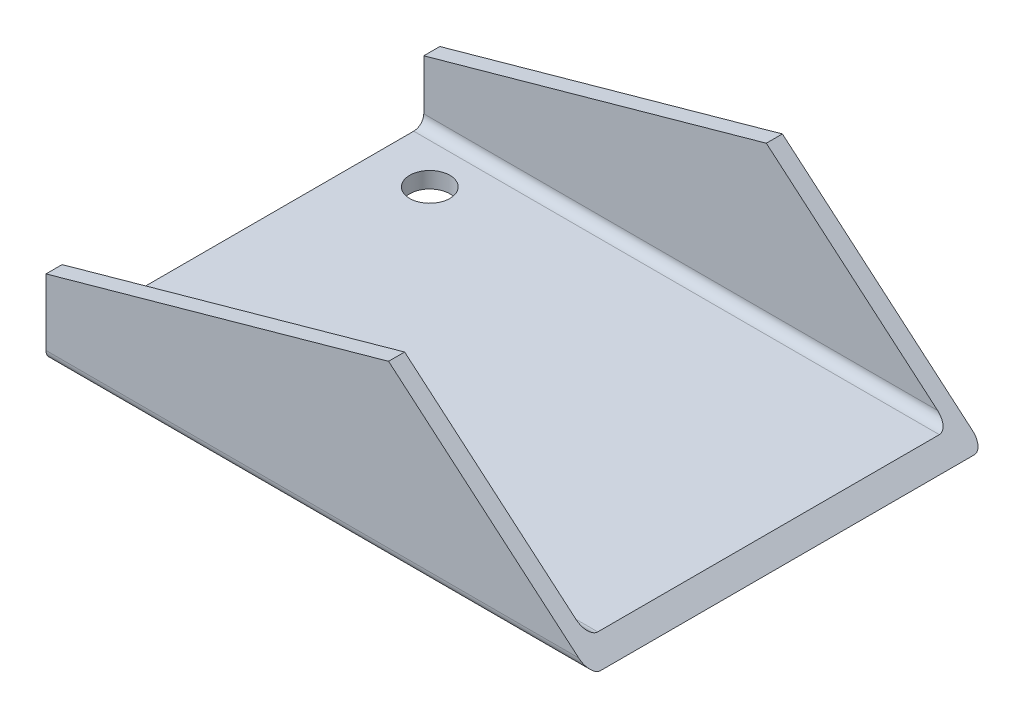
ISO-10303-21;
HEADER;
FILE_DESCRIPTION(('STEP AP214'),'2;1');
FILE_NAME('part.step','',(''),(''),'','','');
FILE_SCHEMA(('AUTOMOTIVE_DESIGN { 1 0 10303 214 1 1 1 1 }'));
ENDSEC;
DATA;
#1=APPLICATION_CONTEXT('core data for automotive mechanical design processes');
#2=APPLICATION_PROTOCOL_DEFINITION('international standard','automotive_design',2000,#1);
#3=PRODUCT_CONTEXT('',#1,'mechanical');
#4=PRODUCT('Part','Part','',(#3));
#5=PRODUCT_RELATED_PRODUCT_CATEGORY('part','',(#4));
#6=PRODUCT_DEFINITION_FORMATION('','',#4);
#7=PRODUCT_DEFINITION_CONTEXT('part definition',#1,'design');
#8=PRODUCT_DEFINITION('design','',#6,#7);
#9=PRODUCT_DEFINITION_SHAPE('','',#8);
#10=(LENGTH_UNIT() NAMED_UNIT(*) SI_UNIT(.MILLI.,.METRE.));
#11=(NAMED_UNIT(*) PLANE_ANGLE_UNIT() SI_UNIT($,.RADIAN.));
#12=(NAMED_UNIT(*) SI_UNIT($,.STERADIAN.) SOLID_ANGLE_UNIT());
#13=UNCERTAINTY_MEASURE_WITH_UNIT(LENGTH_MEASURE(1.E-05),#10,'distance_accuracy_value','');
#14=(GEOMETRIC_REPRESENTATION_CONTEXT(3) GLOBAL_UNCERTAINTY_ASSIGNED_CONTEXT((#13)) GLOBAL_UNIT_ASSIGNED_CONTEXT((#10,
#11,#12)) REPRESENTATION_CONTEXT('',''));
#15=CARTESIAN_POINT('',(0.,0.,0.));
#16=DIRECTION('',(0.,0.,1.));
#17=DIRECTION('',(1.,0.,0.));
#18=AXIS2_PLACEMENT_3D('',#15,#16,#17);
#19=CARTESIAN_POINT('',(-271.,-8.00000000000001,89.9999999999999));
#20=DIRECTION('',(0.,1.,0.));
#21=DIRECTION('',(0.,0.,1.));
#22=AXIS2_PLACEMENT_3D('',#19,#20,#21);
#23=PLANE('',#22);
#24=CARTESIAN_POINT('',(-243.,-8.00000000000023,64.9999999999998));
#25=DIRECTION('',(0.,1.,0.));
#26=DIRECTION('',(0.,0.,1.));
#27=AXIS2_PLACEMENT_3D('',#24,#25,#26);
#28=CIRCLE('',#27,10.);
#29=CARTESIAN_POINT('',(-243.,-8.00000000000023,74.9999999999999));
#30=VERTEX_POINT('',#29);
#31=EDGE_CURVE('E185',#30,#30,#28,.T.);
#32=ORIENTED_EDGE('',*,*,#31,.T.);
#33=EDGE_LOOP('',(#32));
#34=FACE_BOUND('',#33,.T.);
#35=CARTESIAN_POINT('',(-243.,-8.00000000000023,-65.0000000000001));
#36=DIRECTION('',(0.,1.,0.));
#37=DIRECTION('',(0.,0.,1.));
#38=AXIS2_PLACEMENT_3D('',#35,#36,#37);
#39=CIRCLE('',#38,10.);
#40=CARTESIAN_POINT('',(-243.,-8.00000000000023,-55.0000000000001));
#41=VERTEX_POINT('',#40);
#42=EDGE_CURVE('E192',#41,#41,#39,.T.);
#43=ORIENTED_EDGE('',*,*,#42,.T.);
#44=EDGE_LOOP('',(#43));
#45=FACE_BOUND('',#44,.T.);
#46=DIRECTION('',(0.,0.,-0.999999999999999));
#47=VECTOR('',#46,1.);
#48=CARTESIAN_POINT('',(2.22044604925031E-13,-8.00000000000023,89.9999999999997));
#49=LINE('',#48,#47);
#50=CARTESIAN_POINT('',(2.22044604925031E-13,-8.00000000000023,92.9999999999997));
#51=VERTEX_POINT('',#50);
#52=CARTESIAN_POINT('',(4.44089209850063E-13,-8.00000000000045,-93.0000000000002));
#53=VERTEX_POINT('',#52);
#54=EDGE_CURVE('E201',#51,#53,#49,.T.);
#55=ORIENTED_EDGE('',*,*,#54,.F.);
#56=DIRECTION('',(1.,0.,0.));
#57=VECTOR('',#56,1.);
#58=CARTESIAN_POINT('',(-271.,-8.00000000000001,92.9999999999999));
#59=LINE('',#58,#57);
#60=CARTESIAN_POINT('',(-271.,-8.00000000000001,92.9999999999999));
#61=VERTEX_POINT('',#60);
#62=EDGE_CURVE('E212',#51,#61,#59,.F.);
#63=ORIENTED_EDGE('',*,*,#62,.T.);
#64=DIRECTION('',(0.,0.,-0.999999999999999));
#65=VECTOR('',#64,1.);
#66=CARTESIAN_POINT('',(-271.,-8.00000000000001,89.9999999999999));
#67=LINE('',#66,#65);
#68=CARTESIAN_POINT('',(-271.,-8.00000000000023,-93.));
#69=VERTEX_POINT('',#68);
#70=EDGE_CURVE('E195',#61,#69,#67,.T.);
#71=ORIENTED_EDGE('',*,*,#70,.T.);
#72=DIRECTION('',(1.,0.,0.));
#73=VECTOR('',#72,1.);
#74=CARTESIAN_POINT('',(-271.,-8.00000000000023,-93.0000000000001));
#75=LINE('',#74,#73);
#76=EDGE_CURVE('E253',#69,#53,#75,.T.);
#77=ORIENTED_EDGE('',*,*,#76,.T.);
#78=EDGE_LOOP('',(#55,#63,#71,#77));
#79=FACE_BOUND('',#78,.T.);
#80=ADVANCED_FACE('F41',(#34,#45,#79),#23,.F.);
#81=CARTESIAN_POINT('',(-271.,-2.22044604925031E-13,89.9999999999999));
#82=DIRECTION('',(0.,1.,0.));
#83=DIRECTION('',(0.,0.,1.));
#84=AXIS2_PLACEMENT_3D('',#81,#82,#83);
#85=PLANE('',#84);
#86=DIRECTION('',(0.,0.,-0.999999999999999));
#87=VECTOR('',#86,1.);
#88=CARTESIAN_POINT('',(-271.,-2.22044604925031E-13,89.9999999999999));
#89=LINE('',#88,#87);
#90=CARTESIAN_POINT('',(-270.999999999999,-4.44089209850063E-13,84.9999999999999));
#91=VERTEX_POINT('',#90);
#92=CARTESIAN_POINT('',(-270.999999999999,-4.44089209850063E-13,-85.));
#93=VERTEX_POINT('',#92);
#94=EDGE_CURVE('E200',#91,#93,#89,.T.);
#95=ORIENTED_EDGE('',*,*,#94,.F.);
#96=DIRECTION('',(1.,0.,0.));
#97=VECTOR('',#96,1.);
#98=CARTESIAN_POINT('',(-9.3972960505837,0.,84.9999999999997));
#99=LINE('',#98,#97);
#100=CARTESIAN_POINT('',(-9.3972960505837,0.,84.9999999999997));
#101=VERTEX_POINT('',#100);
#102=EDGE_CURVE('E221',#91,#101,#99,.T.);
#103=ORIENTED_EDGE('',*,*,#102,.T.);
#104=DIRECTION('',(0.,0.,1.));
#105=VECTOR('',#104,1.);
#106=CARTESIAN_POINT('',(-9.3972960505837,0.,-98.0000000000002));
#107=LINE('',#106,#105);
#108=CARTESIAN_POINT('',(-9.3972960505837,0.,-85.0000000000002));
#109=VERTEX_POINT('',#108);
#110=EDGE_CURVE('E165',#109,#101,#107,.T.);
#111=ORIENTED_EDGE('',*,*,#110,.F.);
#112=DIRECTION('',(1.,0.,0.));
#113=VECTOR('',#112,1.);
#114=CARTESIAN_POINT('',(-270.999999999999,-4.44089209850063E-13,-85.0000000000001));
#115=LINE('',#114,#113);
#116=EDGE_CURVE('E219',#109,#93,#115,.F.);
#117=ORIENTED_EDGE('',*,*,#116,.T.);
#118=EDGE_LOOP('',(#95,#103,#111,#117));
#119=FACE_BOUND('',#118,.T.);
#120=CARTESIAN_POINT('',(-243.,-2.22044604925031E-13,64.9999999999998));
#121=DIRECTION('',(0.,1.,0.));
#122=DIRECTION('',(0.,0.,1.));
#123=AXIS2_PLACEMENT_3D('',#120,#121,#122);
#124=CIRCLE('',#123,10.);
#125=CARTESIAN_POINT('',(-243.,-2.20309881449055E-13,74.9999999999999));
#126=VERTEX_POINT('',#125);
#127=EDGE_CURVE('E189',#126,#126,#124,.T.);
#128=ORIENTED_EDGE('',*,*,#127,.F.);
#129=EDGE_LOOP('',(#128));
#130=FACE_BOUND('',#129,.T.);
#131=CARTESIAN_POINT('',(-243.,-2.22044604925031E-13,-65.0000000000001));
#132=DIRECTION('',(0.,1.,0.));
#133=DIRECTION('',(0.,0.,1.));
#134=AXIS2_PLACEMENT_3D('',#131,#132,#133);
#135=CIRCLE('',#134,10.);
#136=CARTESIAN_POINT('',(-243.,-2.20309881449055E-13,-55.0000000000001));
#137=VERTEX_POINT('',#136);
#138=EDGE_CURVE('E188',#137,#137,#135,.T.);
#139=ORIENTED_EDGE('',*,*,#138,.F.);
#140=EDGE_LOOP('',(#139));
#141=FACE_BOUND('',#140,.T.);
#142=ADVANCED_FACE('F242',(#119,#130,#141),#85,.T.);
#143=CARTESIAN_POINT('',(-271.,-8.00000000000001,89.9999999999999));
#144=DIRECTION('',(-1.,0.,0.));
#145=DIRECTION('',(0.,0.,1.));
#146=AXIS2_PLACEMENT_3D('',#143,#144,#145);
#147=PLANE('',#146);
#148=ORIENTED_EDGE('',*,*,#70,.F.);
#149=CARTESIAN_POINT('',(-271.,-3.00000000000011,92.9999999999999));
#150=DIRECTION('',(-1.,0.,0.));
#151=DIRECTION('',(0.,0.,1.));
#152=AXIS2_PLACEMENT_3D('',#149,#150,#151);
#153=CIRCLE('',#152,5.);
#154=CARTESIAN_POINT('',(-271.,-3.00000000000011,97.9999999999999));
#155=VERTEX_POINT('',#154);
#156=EDGE_CURVE('E216',#61,#155,#153,.T.);
#157=ORIENTED_EDGE('',*,*,#156,.T.);
#158=DIRECTION('',(0.,-1.,0.));
#159=VECTOR('',#158,1.);
#160=CARTESIAN_POINT('',(-271.,30.,97.9999999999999));
#161=LINE('',#160,#159);
#162=CARTESIAN_POINT('',(-271.,30.,97.9999999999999));
#163=VERTEX_POINT('',#162);
#164=EDGE_CURVE('E172',#163,#155,#161,.T.);
#165=ORIENTED_EDGE('',*,*,#164,.F.);
#166=DIRECTION('',(0.,0.,-1.));
#167=VECTOR('',#166,1.);
#168=CARTESIAN_POINT('',(-271.,30.,97.9999999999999));
#169=LINE('',#168,#167);
#170=CARTESIAN_POINT('',(-271.,30.,89.9999999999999));
#171=VERTEX_POINT('',#170);
#172=EDGE_CURVE('E175',#163,#171,#169,.T.);
#173=ORIENTED_EDGE('',*,*,#172,.T.);
#174=DIRECTION('',(0.,-1.,0.));
#175=VECTOR('',#174,1.);
#176=CARTESIAN_POINT('',(-271.,30.,89.9999999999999));
#177=LINE('',#176,#175);
#178=CARTESIAN_POINT('',(-271.,4.99999999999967,89.9999999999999));
#179=VERTEX_POINT('',#178);
#180=EDGE_CURVE('E170',#171,#179,#177,.T.);
#181=ORIENTED_EDGE('',*,*,#180,.T.);
#182=CARTESIAN_POINT('',(-271.,4.99999999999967,84.9999999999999));
#183=DIRECTION('',(-1.,0.,0.));
#184=DIRECTION('',(0.,0.,1.));
#185=AXIS2_PLACEMENT_3D('',#182,#183,#184);
#186=CIRCLE('',#185,5.);
#187=EDGE_CURVE('E230',#179,#91,#186,.F.);
#188=ORIENTED_EDGE('',*,*,#187,.T.);
#189=ORIENTED_EDGE('',*,*,#94,.T.);
#190=CARTESIAN_POINT('',(-271.,4.99999999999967,-85.0000000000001));
#191=DIRECTION('',(-1.,0.,0.));
#192=DIRECTION('',(0.,0.,1.));
#193=AXIS2_PLACEMENT_3D('',#190,#191,#192);
#194=CIRCLE('',#193,5.);
#195=CARTESIAN_POINT('',(-271.,4.99999999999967,-90.0000000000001));
#196=VERTEX_POINT('',#195);
#197=EDGE_CURVE('E11',#93,#196,#194,.F.);
#198=ORIENTED_EDGE('',*,*,#197,.T.);
#199=DIRECTION('',(0.,-1.,0.));
#200=VECTOR('',#199,1.);
#201=CARTESIAN_POINT('',(-271.,30.,-90.0000000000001));
#202=LINE('',#201,#200);
#203=CARTESIAN_POINT('',(-271.,30.,-90.0000000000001));
#204=VERTEX_POINT('',#203);
#205=EDGE_CURVE('E138',#204,#196,#202,.T.);
#206=ORIENTED_EDGE('',*,*,#205,.F.);
#207=DIRECTION('',(0.,0.,1.));
#208=VECTOR('',#207,1.);
#209=CARTESIAN_POINT('',(-271.,30.,-98.0000000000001));
#210=LINE('',#209,#208);
#211=CARTESIAN_POINT('',(-271.,30.,-98.0000000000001));
#212=VERTEX_POINT('',#211);
#213=EDGE_CURVE('E132',#212,#204,#210,.T.);
#214=ORIENTED_EDGE('',*,*,#213,.F.);
#215=DIRECTION('',(0.,-1.,0.));
#216=VECTOR('',#215,1.);
#217=CARTESIAN_POINT('',(-271.,30.,-98.0000000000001));
#218=LINE('',#217,#216);
#219=CARTESIAN_POINT('',(-271.,-3.00000000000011,-98.0000000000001));
#220=VERTEX_POINT('',#219);
#221=EDGE_CURVE('E135',#212,#220,#218,.T.);
#222=ORIENTED_EDGE('',*,*,#221,.T.);
#223=CARTESIAN_POINT('',(-271.,-3.00000000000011,-93.0000000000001));
#224=DIRECTION('',(-1.,0.,0.));
#225=DIRECTION('',(0.,0.,1.));
#226=AXIS2_PLACEMENT_3D('',#223,#224,#225);
#227=CIRCLE('',#226,5.);
#228=EDGE_CURVE('E214',#220,#69,#227,.T.);
#229=ORIENTED_EDGE('',*,*,#228,.T.);
#230=EDGE_LOOP('',(#148,#157,#165,#173,#181,#188,#189,#198,#206,#214,#222,#229));
#231=FACE_BOUND('',#230,.T.);
#232=ADVANCED_FACE('F134',(#231),#147,.T.);
#233=CARTESIAN_POINT('',(-243.,-8.00000000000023,-65.0000000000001));
#234=DIRECTION('',(0.,1.,0.));
#235=DIRECTION('',(0.,0.,1.));
#236=AXIS2_PLACEMENT_3D('',#233,#234,#235);
#237=CYLINDRICAL_SURFACE('',#236,10.);
#238=CARTESIAN_POINT('',(-243.,-8.00000000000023,-55.0000000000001));
#239=CARTESIAN_POINT('',(-243.,-7.91666666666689,-55.0000000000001));
#240=CARTESIAN_POINT('',(-243.,-7.83333333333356,-55.0000000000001));
#241=CARTESIAN_POINT('',(-243.,-7.66666666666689,-55.0000000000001));
#242=CARTESIAN_POINT('',(-243.,-7.58333333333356,-55.0000000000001));
#243=CARTESIAN_POINT('',(-243.,-7.41666666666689,-55.0000000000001));
#244=CARTESIAN_POINT('',(-243.,-7.33333333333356,-55.0000000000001));
#245=CARTESIAN_POINT('',(-243.,-7.16666666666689,-55.0000000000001));
#246=CARTESIAN_POINT('',(-243.,-7.08333333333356,-55.0000000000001));
#247=CARTESIAN_POINT('',(-243.,-6.91666666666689,-55.0000000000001));
#248=CARTESIAN_POINT('',(-243.,-6.83333333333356,-55.0000000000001));
#249=CARTESIAN_POINT('',(-243.,-6.66666666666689,-55.0000000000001));
#250=CARTESIAN_POINT('',(-243.,-6.58333333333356,-55.0000000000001));
#251=CARTESIAN_POINT('',(-243.,-6.41666666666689,-55.0000000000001));
#252=CARTESIAN_POINT('',(-243.,-6.33333333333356,-55.0000000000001));
#253=CARTESIAN_POINT('',(-243.,-6.16666666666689,-55.0000000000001));
#254=CARTESIAN_POINT('',(-243.,-6.08333333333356,-55.0000000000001));
#255=CARTESIAN_POINT('',(-243.,-5.91666666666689,-55.0000000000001));
#256=CARTESIAN_POINT('',(-243.,-5.83333333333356,-55.0000000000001));
#257=CARTESIAN_POINT('',(-243.,-5.66666666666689,-55.0000000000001));
#258=CARTESIAN_POINT('',(-243.,-5.58333333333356,-55.0000000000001));
#259=CARTESIAN_POINT('',(-243.,-5.41666666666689,-55.0000000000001));
#260=CARTESIAN_POINT('',(-243.,-5.33333333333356,-55.0000000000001));
#261=CARTESIAN_POINT('',(-243.,-5.16666666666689,-55.0000000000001));
#262=CARTESIAN_POINT('',(-243.,-5.08333333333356,-55.0000000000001));
#263=CARTESIAN_POINT('',(-243.,-4.91666666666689,-55.0000000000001));
#264=CARTESIAN_POINT('',(-243.,-4.83333333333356,-55.0000000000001));
#265=CARTESIAN_POINT('',(-243.,-4.66666666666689,-55.0000000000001));
#266=CARTESIAN_POINT('',(-243.,-4.58333333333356,-55.0000000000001));
#267=CARTESIAN_POINT('',(-243.,-4.41666666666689,-55.0000000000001));
#268=CARTESIAN_POINT('',(-243.,-4.33333333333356,-55.0000000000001));
#269=CARTESIAN_POINT('',(-243.,-4.16666666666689,-55.0000000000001));
#270=CARTESIAN_POINT('',(-243.,-4.08333333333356,-55.0000000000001));
#271=CARTESIAN_POINT('',(-243.,-3.91666666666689,-55.0000000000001));
#272=CARTESIAN_POINT('',(-243.,-3.83333333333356,-55.0000000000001));
#273=CARTESIAN_POINT('',(-243.,-3.66666666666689,-55.0000000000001));
#274=CARTESIAN_POINT('',(-243.,-3.58333333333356,-55.0000000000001));
#275=CARTESIAN_POINT('',(-243.,-3.41666666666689,-55.0000000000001));
#276=CARTESIAN_POINT('',(-243.,-3.33333333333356,-55.0000000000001));
#277=CARTESIAN_POINT('',(-243.,-3.16666666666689,-55.0000000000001));
#278=CARTESIAN_POINT('',(-243.,-3.08333333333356,-55.0000000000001));
#279=CARTESIAN_POINT('',(-243.,-2.91666666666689,-55.0000000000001));
#280=CARTESIAN_POINT('',(-243.,-2.83333333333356,-55.0000000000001));
#281=CARTESIAN_POINT('',(-243.,-2.66666666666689,-55.0000000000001));
#282=CARTESIAN_POINT('',(-243.,-2.58333333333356,-55.0000000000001));
#283=CARTESIAN_POINT('',(-243.,-2.41666666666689,-55.0000000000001));
#284=CARTESIAN_POINT('',(-243.,-2.33333333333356,-55.0000000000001));
#285=CARTESIAN_POINT('',(-243.,-2.16666666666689,-55.0000000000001));
#286=CARTESIAN_POINT('',(-243.,-2.08333333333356,-55.0000000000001));
#287=CARTESIAN_POINT('',(-243.,-1.91666666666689,-55.0000000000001));
#288=CARTESIAN_POINT('',(-243.,-1.83333333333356,-55.0000000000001));
#289=CARTESIAN_POINT('',(-243.,-1.66666666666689,-55.0000000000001));
#290=CARTESIAN_POINT('',(-243.,-1.58333333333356,-55.0000000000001));
#291=CARTESIAN_POINT('',(-243.,-1.41666666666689,-55.0000000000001));
#292=CARTESIAN_POINT('',(-243.,-1.33333333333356,-55.0000000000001));
#293=CARTESIAN_POINT('',(-243.,-1.16666666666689,-55.0000000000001));
#294=CARTESIAN_POINT('',(-243.,-1.08333333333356,-55.0000000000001));
#295=CARTESIAN_POINT('',(-243.,-0.916666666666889,-55.0000000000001));
#296=CARTESIAN_POINT('',(-243.,-0.833333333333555,-55.0000000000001));
#297=CARTESIAN_POINT('',(-243.,-0.666666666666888,-55.0000000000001));
#298=CARTESIAN_POINT('',(-243.,-0.583333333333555,-55.0000000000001));
#299=CARTESIAN_POINT('',(-243.,-0.416666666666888,-55.0000000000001));
#300=CARTESIAN_POINT('',(-243.,-0.333333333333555,-55.0000000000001));
#301=CARTESIAN_POINT('',(-243.,-0.166666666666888,-55.0000000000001));
#302=CARTESIAN_POINT('',(-243.,-0.083333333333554,-55.0000000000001));
#303=CARTESIAN_POINT('',(-243.,-2.20309881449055E-13,-55.0000000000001));
#304=B_SPLINE_CURVE_WITH_KNOTS('',3,(#238,#239,#240,#241,#242,#243,#244,#245,#246,#247,#248,
#249,#250,#251,#252,#253,#254,#255,#256,#257,#258,#259,#260,#261,#262,#263,#264,#265,#266,#267,
#268,#269,#270,#271,#272,#273,#274,#275,#276,#277,#278,#279,#280,#281,#282,#283,#284,#285,#286,
#287,#288,#289,#290,#291,#292,#293,#294,#295,#296,#297,#298,#299,#300,#301,#302,#303),
.UNSPECIFIED.,.F.,.F.,(4,2,2,2,2,2,2,2,2,2,2,2,2,2,2,2,2,2,2,2,2,2,2,2,2,2,2,2,2,2,2,2,4),(0.,
0.249999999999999,0.5,0.75,1.,1.25,1.5,1.75,2.,2.25,2.5,2.75,3.,3.25,3.5,3.75,4.,4.25,4.5,4.75,
5.,5.25,5.5,5.75,6.,6.25,6.50000000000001,6.75000000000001,7.00000000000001,7.25000000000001,
7.50000000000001,7.75000000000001,8.00000000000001),.UNSPECIFIED.);
#305=EDGE_CURVE('BSEAM295',#41,#137,#304,.T.);
#306=ORIENTED_EDGE('',*,*,#42,.F.);
#307=ORIENTED_EDGE('',*,*,#138,.T.);
#308=ORIENTED_EDGE('',*,*,#305,.T.);
#309=ORIENTED_EDGE('',*,*,#305,.F.);
#310=EDGE_LOOP('',(#306,#308,#307,#309));
#311=FACE_BOUND('',#310,.T.);
#312=ADVANCED_FACE('F295',(#311),#237,.F.);
#313=CARTESIAN_POINT('',(-243.,-8.00000000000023,64.9999999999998));
#314=DIRECTION('',(0.,1.,0.));
#315=DIRECTION('',(0.,0.,1.));
#316=AXIS2_PLACEMENT_3D('',#313,#314,#315);
#317=CYLINDRICAL_SURFACE('',#316,10.);
#318=CARTESIAN_POINT('',(-243.,-8.00000000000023,74.9999999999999));
#319=CARTESIAN_POINT('',(-243.,-7.91666666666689,74.9999999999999));
#320=CARTESIAN_POINT('',(-243.,-7.83333333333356,74.9999999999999));
#321=CARTESIAN_POINT('',(-243.,-7.66666666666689,74.9999999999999));
#322=CARTESIAN_POINT('',(-243.,-7.58333333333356,74.9999999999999));
#323=CARTESIAN_POINT('',(-243.,-7.41666666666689,74.9999999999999));
#324=CARTESIAN_POINT('',(-243.,-7.33333333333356,74.9999999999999));
#325=CARTESIAN_POINT('',(-243.,-7.16666666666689,74.9999999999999));
#326=CARTESIAN_POINT('',(-243.,-7.08333333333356,74.9999999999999));
#327=CARTESIAN_POINT('',(-243.,-6.91666666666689,74.9999999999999));
#328=CARTESIAN_POINT('',(-243.,-6.83333333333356,74.9999999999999));
#329=CARTESIAN_POINT('',(-243.,-6.66666666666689,74.9999999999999));
#330=CARTESIAN_POINT('',(-243.,-6.58333333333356,74.9999999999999));
#331=CARTESIAN_POINT('',(-243.,-6.41666666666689,74.9999999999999));
#332=CARTESIAN_POINT('',(-243.,-6.33333333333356,74.9999999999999));
#333=CARTESIAN_POINT('',(-243.,-6.16666666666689,74.9999999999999));
#334=CARTESIAN_POINT('',(-243.,-6.08333333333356,74.9999999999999));
#335=CARTESIAN_POINT('',(-243.,-5.91666666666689,74.9999999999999));
#336=CARTESIAN_POINT('',(-243.,-5.83333333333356,74.9999999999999));
#337=CARTESIAN_POINT('',(-243.,-5.66666666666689,74.9999999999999));
#338=CARTESIAN_POINT('',(-243.,-5.58333333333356,74.9999999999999));
#339=CARTESIAN_POINT('',(-243.,-5.41666666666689,74.9999999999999));
#340=CARTESIAN_POINT('',(-243.,-5.33333333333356,74.9999999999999));
#341=CARTESIAN_POINT('',(-243.,-5.16666666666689,74.9999999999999));
#342=CARTESIAN_POINT('',(-243.,-5.08333333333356,74.9999999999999));
#343=CARTESIAN_POINT('',(-243.,-4.91666666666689,74.9999999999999));
#344=CARTESIAN_POINT('',(-243.,-4.83333333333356,74.9999999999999));
#345=CARTESIAN_POINT('',(-243.,-4.66666666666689,74.9999999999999));
#346=CARTESIAN_POINT('',(-243.,-4.58333333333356,74.9999999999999));
#347=CARTESIAN_POINT('',(-243.,-4.41666666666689,74.9999999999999));
#348=CARTESIAN_POINT('',(-243.,-4.33333333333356,74.9999999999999));
#349=CARTESIAN_POINT('',(-243.,-4.16666666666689,74.9999999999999));
#350=CARTESIAN_POINT('',(-243.,-4.08333333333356,74.9999999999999));
#351=CARTESIAN_POINT('',(-243.,-3.91666666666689,74.9999999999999));
#352=CARTESIAN_POINT('',(-243.,-3.83333333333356,74.9999999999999));
#353=CARTESIAN_POINT('',(-243.,-3.66666666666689,74.9999999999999));
#354=CARTESIAN_POINT('',(-243.,-3.58333333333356,74.9999999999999));
#355=CARTESIAN_POINT('',(-243.,-3.41666666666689,74.9999999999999));
#356=CARTESIAN_POINT('',(-243.,-3.33333333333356,74.9999999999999));
#357=CARTESIAN_POINT('',(-243.,-3.16666666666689,74.9999999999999));
#358=CARTESIAN_POINT('',(-243.,-3.08333333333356,74.9999999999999));
#359=CARTESIAN_POINT('',(-243.,-2.91666666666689,74.9999999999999));
#360=CARTESIAN_POINT('',(-243.,-2.83333333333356,74.9999999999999));
#361=CARTESIAN_POINT('',(-243.,-2.66666666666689,74.9999999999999));
#362=CARTESIAN_POINT('',(-243.,-2.58333333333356,74.9999999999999));
#363=CARTESIAN_POINT('',(-243.,-2.41666666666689,74.9999999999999));
#364=CARTESIAN_POINT('',(-243.,-2.33333333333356,74.9999999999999));
#365=CARTESIAN_POINT('',(-243.,-2.16666666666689,74.9999999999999));
#366=CARTESIAN_POINT('',(-243.,-2.08333333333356,74.9999999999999));
#367=CARTESIAN_POINT('',(-243.,-1.91666666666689,74.9999999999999));
#368=CARTESIAN_POINT('',(-243.,-1.83333333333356,74.9999999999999));
#369=CARTESIAN_POINT('',(-243.,-1.66666666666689,74.9999999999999));
#370=CARTESIAN_POINT('',(-243.,-1.58333333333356,74.9999999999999));
#371=CARTESIAN_POINT('',(-243.,-1.41666666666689,74.9999999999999));
#372=CARTESIAN_POINT('',(-243.,-1.33333333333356,74.9999999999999));
#373=CARTESIAN_POINT('',(-243.,-1.16666666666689,74.9999999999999));
#374=CARTESIAN_POINT('',(-243.,-1.08333333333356,74.9999999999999));
#375=CARTESIAN_POINT('',(-243.,-0.916666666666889,74.9999999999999));
#376=CARTESIAN_POINT('',(-243.,-0.833333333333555,74.9999999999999));
#377=CARTESIAN_POINT('',(-243.,-0.666666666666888,74.9999999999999));
#378=CARTESIAN_POINT('',(-243.,-0.583333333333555,74.9999999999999));
#379=CARTESIAN_POINT('',(-243.,-0.416666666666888,74.9999999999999));
#380=CARTESIAN_POINT('',(-243.,-0.333333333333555,74.9999999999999));
#381=CARTESIAN_POINT('',(-243.,-0.166666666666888,74.9999999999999));
#382=CARTESIAN_POINT('',(-243.,-0.083333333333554,74.9999999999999));
#383=CARTESIAN_POINT('',(-243.,-2.20309881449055E-13,74.9999999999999));
#384=B_SPLINE_CURVE_WITH_KNOTS('',3,(#318,#319,#320,#321,#322,#323,#324,#325,#326,#327,#328,
#329,#330,#331,#332,#333,#334,#335,#336,#337,#338,#339,#340,#341,#342,#343,#344,#345,#346,#347,
#348,#349,#350,#351,#352,#353,#354,#355,#356,#357,#358,#359,#360,#361,#362,#363,#364,#365,#366,
#367,#368,#369,#370,#371,#372,#373,#374,#375,#376,#377,#378,#379,#380,#381,#382,#383),
.UNSPECIFIED.,.F.,.F.,(4,2,2,2,2,2,2,2,2,2,2,2,2,2,2,2,2,2,2,2,2,2,2,2,2,2,2,2,2,2,2,2,4),(0.,
0.249999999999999,0.5,0.75,1.,1.25,1.5,1.75,2.,2.25,2.5,2.75,3.,3.25,3.5,3.75,4.,4.25,4.5,4.75,
5.,5.25,5.5,5.75,6.,6.25,6.50000000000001,6.75000000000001,7.00000000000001,7.25000000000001,
7.50000000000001,7.75000000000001,8.00000000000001),.UNSPECIFIED.);
#385=EDGE_CURVE('BSEAM298',#30,#126,#384,.T.);
#386=ORIENTED_EDGE('',*,*,#31,.F.);
#387=ORIENTED_EDGE('',*,*,#127,.T.);
#388=ORIENTED_EDGE('',*,*,#385,.T.);
#389=ORIENTED_EDGE('',*,*,#385,.F.);
#390=EDGE_LOOP('',(#386,#388,#387,#389));
#391=FACE_BOUND('',#390,.T.);
#392=ADVANCED_FACE('F298',(#391),#317,.F.);
#393=CARTESIAN_POINT('',(-271.,-8.00000000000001,89.9999999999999));
#394=DIRECTION('',(0.,0.,-1.));
#395=DIRECTION('',(-1.,0.,0.));
#396=AXIS2_PLACEMENT_3D('',#393,#394,#395);
#397=PLANE('',#396);
#398=DIRECTION('',(-0.761447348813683,0.648226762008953,0.));
#399=VECTOR('',#398,1.);
#400=CARTESIAN_POINT('',(2.22044604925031E-13,-8.00000000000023,89.9999999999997));
#401=LINE('',#400,#399);
#402=CARTESIAN_POINT('',(-15.2706060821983,4.99999999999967,90.));
#403=VERTEX_POINT('',#402);
#404=CARTESIAN_POINT('',(-100.511050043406,77.5659325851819,90.));
#405=VERTEX_POINT('',#404);
#406=EDGE_CURVE('E143',#403,#405,#401,.T.);
#407=ORIENTED_EDGE('',*,*,#406,.F.);
#408=DIRECTION('',(1.,0.,0.));
#409=VECTOR('',#408,1.);
#410=CARTESIAN_POINT('',(-271.,4.99999999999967,89.9999999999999));
#411=LINE('',#410,#409);
#412=EDGE_CURVE('E56',#403,#179,#411,.F.);
#413=ORIENTED_EDGE('',*,*,#412,.T.);
#414=ORIENTED_EDGE('',*,*,#180,.F.);
#415=DIRECTION('',(-0.963214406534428,-0.268734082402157,0.));
#416=VECTOR('',#415,1.);
#417=CARTESIAN_POINT('',(-100.511050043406,77.5659325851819,90.));
#418=LINE('',#417,#416);
#419=EDGE_CURVE('E177',#405,#171,#418,.T.);
#420=ORIENTED_EDGE('',*,*,#419,.F.);
#421=EDGE_LOOP('',(#407,#413,#414,#420));
#422=FACE_BOUND('',#421,.T.);
#423=ADVANCED_FACE('F302',(#422),#397,.T.);
#424=CARTESIAN_POINT('',(2.22044604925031E-13,-8.00000000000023,97.9999999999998));
#425=DIRECTION('',(-0.648226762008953,-0.761447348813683,0.));
#426=DIRECTION('',(0.761447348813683,-0.648226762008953,0.));
#427=AXIS2_PLACEMENT_3D('',#424,#425,#426);
#428=PLANE('',#427);
#429=DIRECTION('',(-0.761447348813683,0.648226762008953,0.));
#430=VECTOR('',#429,1.);
#431=CARTESIAN_POINT('',(2.22044604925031E-13,-8.00000000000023,97.9999999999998));
#432=LINE('',#431,#430);
#433=CARTESIAN_POINT('',(-5.87331003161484,-3.00000000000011,97.9999999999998));
#434=VERTEX_POINT('',#433);
#435=CARTESIAN_POINT('',(-100.511050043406,77.5659325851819,98.));
#436=VERTEX_POINT('',#435);
#437=EDGE_CURVE('E167',#434,#436,#432,.T.);
#438=ORIENTED_EDGE('',*,*,#437,.F.);
#439=CARTESIAN_POINT('',(-5.87331003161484,-3.00000000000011,92.9999999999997));
#440=DIRECTION('',(-0.648226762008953,-0.761447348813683,0.));
#441=DIRECTION('',(0.761447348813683,-0.648226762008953,0.));
#442=AXIS2_PLACEMENT_3D('',#439,#440,#441);
#443=ELLIPSE('',#442,7.71335016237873,5.);
#444=EDGE_CURVE('E259',#434,#51,#443,.F.);
#445=ORIENTED_EDGE('',*,*,#444,.T.);
#446=ORIENTED_EDGE('',*,*,#54,.T.);
#447=CARTESIAN_POINT('',(-5.87331003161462,-3.00000000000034,-93.0000000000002));
#448=DIRECTION('',(-0.648226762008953,-0.761447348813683,0.));
#449=DIRECTION('',(0.761447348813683,-0.648226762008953,0.));
#450=AXIS2_PLACEMENT_3D('',#447,#448,#449);
#451=ELLIPSE('',#450,7.71335016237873,5.);
#452=CARTESIAN_POINT('',(-5.87331003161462,-3.00000000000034,-98.0000000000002));
#453=VERTEX_POINT('',#452);
#454=EDGE_CURVE('E248',#53,#453,#451,.F.);
#455=ORIENTED_EDGE('',*,*,#454,.T.);
#456=DIRECTION('',(-0.761447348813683,0.648226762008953,0.));
#457=VECTOR('',#456,1.);
#458=CARTESIAN_POINT('',(4.44089209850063E-13,-8.00000000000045,-98.0000000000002));
#459=LINE('',#458,#457);
#460=CARTESIAN_POINT('',(-100.511050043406,77.5659325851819,-98.));
#461=VERTEX_POINT('',#460);
#462=EDGE_CURVE('E154',#453,#461,#459,.T.);
#463=ORIENTED_EDGE('',*,*,#462,.T.);
#464=DIRECTION('',(0.,0.,1.));
#465=VECTOR('',#464,1.);
#466=CARTESIAN_POINT('',(-100.511050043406,77.5659325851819,-98.));
#467=LINE('',#466,#465);
#468=CARTESIAN_POINT('',(-100.511050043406,77.5659325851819,-90.));
#469=VERTEX_POINT('',#468);
#470=EDGE_CURVE('E144',#461,#469,#467,.T.);
#471=ORIENTED_EDGE('',*,*,#470,.T.);
#472=DIRECTION('',(-0.761447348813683,0.648226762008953,0.));
#473=VECTOR('',#472,1.);
#474=CARTESIAN_POINT('',(4.44089209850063E-13,-8.00000000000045,-90.0000000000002));
#475=LINE('',#474,#473);
#476=CARTESIAN_POINT('',(-15.2706060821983,4.99999999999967,-90.));
#477=VERTEX_POINT('',#476);
#478=EDGE_CURVE('E149',#477,#469,#475,.T.);
#479=ORIENTED_EDGE('',*,*,#478,.F.);
#480=CARTESIAN_POINT('',(-15.2706060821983,4.99999999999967,-85.));
#481=DIRECTION('',(-0.648226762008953,-0.761447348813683,0.));
#482=DIRECTION('',(-0.761447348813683,0.648226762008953,0.));
#483=AXIS2_PLACEMENT_3D('',#480,#481,#482);
#484=ELLIPSE('',#483,7.71335016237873,5.);
#485=EDGE_CURVE('E49',#477,#109,#484,.T.);
#486=ORIENTED_EDGE('',*,*,#485,.T.);
#487=ORIENTED_EDGE('',*,*,#110,.T.);
#488=CARTESIAN_POINT('',(-15.2706060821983,4.99999999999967,85.));
#489=DIRECTION('',(-0.648226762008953,-0.761447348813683,0.));
#490=DIRECTION('',(-0.761447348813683,0.648226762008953,0.));
#491=AXIS2_PLACEMENT_3D('',#488,#489,#490);
#492=ELLIPSE('',#491,7.71335016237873,5.);
#493=EDGE_CURVE('E228',#101,#403,#492,.T.);
#494=ORIENTED_EDGE('',*,*,#493,.T.);
#495=ORIENTED_EDGE('',*,*,#406,.T.);
#496=DIRECTION('',(0.,0.,-1.));
#497=VECTOR('',#496,1.);
#498=CARTESIAN_POINT('',(-100.511050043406,77.5659325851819,98.));
#499=LINE('',#498,#497);
#500=EDGE_CURVE('E184',#436,#405,#499,.T.);
#501=ORIENTED_EDGE('',*,*,#500,.F.);
#502=EDGE_LOOP('',(#438,#445,#446,#455,#463,#471,#479,#486,#487,#494,#495,#501));
#503=FACE_BOUND('',#502,.T.);
#504=ADVANCED_FACE('F236',(#503),#428,.F.);
#505=CARTESIAN_POINT('',(-100.511050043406,77.5659325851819,98.));
#506=DIRECTION('',(0.268734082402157,-0.963214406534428,0.));
#507=DIRECTION('',(0.963214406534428,0.268734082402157,0.));
#508=AXIS2_PLACEMENT_3D('',#505,#506,#507);
#509=PLANE('',#508);
#510=ORIENTED_EDGE('',*,*,#419,.T.);
#511=ORIENTED_EDGE('',*,*,#172,.F.);
#512=DIRECTION('',(-0.963214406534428,-0.268734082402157,0.));
#513=VECTOR('',#512,1.);
#514=CARTESIAN_POINT('',(-100.511050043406,77.5659325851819,98.));
#515=LINE('',#514,#513);
#516=EDGE_CURVE('E169',#436,#163,#515,.T.);
#517=ORIENTED_EDGE('',*,*,#516,.F.);
#518=ORIENTED_EDGE('',*,*,#500,.T.);
#519=EDGE_LOOP('',(#510,#511,#517,#518));
#520=FACE_BOUND('',#519,.T.);
#521=ADVANCED_FACE('F272',(#520),#509,.F.);
#522=CARTESIAN_POINT('',(-271.,-8.00000000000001,97.9999999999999));
#523=DIRECTION('',(0.,0.,-1.));
#524=DIRECTION('',(-1.,0.,0.));
#525=AXIS2_PLACEMENT_3D('',#522,#523,#524);
#526=PLANE('',#525);
#527=ORIENTED_EDGE('',*,*,#164,.T.);
#528=DIRECTION('',(1.,0.,0.));
#529=VECTOR('',#528,1.);
#530=CARTESIAN_POINT('',(-271.,-3.00000000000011,97.9999999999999));
#531=LINE('',#530,#529);
#532=EDGE_CURVE('E204',#155,#434,#531,.T.);
#533=ORIENTED_EDGE('',*,*,#532,.T.);
#534=ORIENTED_EDGE('',*,*,#437,.T.);
#535=ORIENTED_EDGE('',*,*,#516,.T.);
#536=EDGE_LOOP('',(#527,#533,#534,#535));
#537=FACE_BOUND('',#536,.T.);
#538=ADVANCED_FACE('F264',(#537),#526,.F.);
#539=CARTESIAN_POINT('',(-100.511050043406,77.5659325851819,-98.));
#540=DIRECTION('',(-0.268734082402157,0.963214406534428,0.));
#541=DIRECTION('',(-0.963214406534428,-0.268734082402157,0.));
#542=AXIS2_PLACEMENT_3D('',#539,#540,#541);
#543=PLANE('',#542);
#544=DIRECTION('',(-0.963214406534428,-0.268734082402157,0.));
#545=VECTOR('',#544,1.);
#546=CARTESIAN_POINT('',(-100.511050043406,77.5659325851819,-90.));
#547=LINE('',#546,#545);
#548=EDGE_CURVE('E161',#469,#204,#547,.T.);
#549=ORIENTED_EDGE('',*,*,#548,.F.);
#550=ORIENTED_EDGE('',*,*,#470,.F.);
#551=DIRECTION('',(-0.963214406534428,-0.268734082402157,0.));
#552=VECTOR('',#551,1.);
#553=CARTESIAN_POINT('',(-100.511050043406,77.5659325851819,-98.));
#554=LINE('',#553,#552);
#555=EDGE_CURVE('E148',#461,#212,#554,.T.);
#556=ORIENTED_EDGE('',*,*,#555,.T.);
#557=ORIENTED_EDGE('',*,*,#213,.T.);
#558=EDGE_LOOP('',(#549,#550,#556,#557));
#559=FACE_BOUND('',#558,.T.);
#560=ADVANCED_FACE('F152',(#559),#543,.T.);
#561=CARTESIAN_POINT('',(-271.,-8.00000000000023,-98.0000000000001));
#562=DIRECTION('',(0.,0.,1.));
#563=DIRECTION('',(-1.,0.,0.));
#564=AXIS2_PLACEMENT_3D('',#561,#562,#563);
#565=PLANE('',#564);
#566=ORIENTED_EDGE('',*,*,#462,.F.);
#567=DIRECTION('',(1.,0.,0.));
#568=VECTOR('',#567,1.);
#569=CARTESIAN_POINT('',(-271.,-3.00000000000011,-98.0000000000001));
#570=LINE('',#569,#568);
#571=EDGE_CURVE('E64',#453,#220,#570,.F.);
#572=ORIENTED_EDGE('',*,*,#571,.T.);
#573=ORIENTED_EDGE('',*,*,#221,.F.);
#574=ORIENTED_EDGE('',*,*,#555,.F.);
#575=EDGE_LOOP('',(#566,#572,#573,#574));
#576=FACE_BOUND('',#575,.T.);
#577=ADVANCED_FACE('F147',(#576),#565,.F.);
#578=CARTESIAN_POINT('',(-271.,-8.00000000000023,-90.0000000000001));
#579=DIRECTION('',(0.,0.,1.));
#580=DIRECTION('',(-1.,0.,0.));
#581=AXIS2_PLACEMENT_3D('',#578,#579,#580);
#582=PLANE('',#581);
#583=ORIENTED_EDGE('',*,*,#205,.T.);
#584=DIRECTION('',(1.,0.,0.));
#585=VECTOR('',#584,1.);
#586=CARTESIAN_POINT('',(-9.3972960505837,5.00000000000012,-90.));
#587=LINE('',#586,#585);
#588=EDGE_CURVE('E225',#196,#477,#587,.T.);
#589=ORIENTED_EDGE('',*,*,#588,.T.);
#590=ORIENTED_EDGE('',*,*,#478,.T.);
#591=ORIENTED_EDGE('',*,*,#548,.T.);
#592=EDGE_LOOP('',(#583,#589,#590,#591));
#593=FACE_BOUND('',#592,.T.);
#594=ADVANCED_FACE('F247',(#593),#582,.T.);
#595=CARTESIAN_POINT('',(-271.,-3.00000000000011,92.9999999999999));
#596=DIRECTION('',(1.,0.,0.));
#597=DIRECTION('',(0.,0.,-1.));
#598=AXIS2_PLACEMENT_3D('',#595,#596,#597);
#599=CYLINDRICAL_SURFACE('',#598,5.);
#600=ORIENTED_EDGE('',*,*,#156,.F.);
#601=ORIENTED_EDGE('',*,*,#62,.F.);
#602=ORIENTED_EDGE('',*,*,#444,.F.);
#603=ORIENTED_EDGE('',*,*,#532,.F.);
#604=EDGE_LOOP('',(#600,#601,#602,#603));
#605=FACE_BOUND('',#604,.T.);
#606=ADVANCED_FACE('F274',(#605),#599,.T.);
#607=CARTESIAN_POINT('',(-271.,-3.00000000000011,-93.0000000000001));
#608=DIRECTION('',(1.,0.,0.));
#609=DIRECTION('',(0.,0.,-1.));
#610=AXIS2_PLACEMENT_3D('',#607,#608,#609);
#611=CYLINDRICAL_SURFACE('',#610,5.);
#612=ORIENTED_EDGE('',*,*,#228,.F.);
#613=ORIENTED_EDGE('',*,*,#571,.F.);
#614=ORIENTED_EDGE('',*,*,#454,.F.);
#615=ORIENTED_EDGE('',*,*,#76,.F.);
#616=EDGE_LOOP('',(#612,#613,#614,#615));
#617=FACE_BOUND('',#616,.T.);
#618=ADVANCED_FACE('F250',(#617),#611,.T.);
#619=CARTESIAN_POINT('',(-271.,4.99999999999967,84.9999999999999));
#620=DIRECTION('',(-1.,0.,0.));
#621=DIRECTION('',(0.,0.,1.));
#622=AXIS2_PLACEMENT_3D('',#619,#620,#621);
#623=CYLINDRICAL_SURFACE('',#622,5.);
#624=ORIENTED_EDGE('',*,*,#187,.F.);
#625=ORIENTED_EDGE('',*,*,#412,.F.);
#626=ORIENTED_EDGE('',*,*,#493,.F.);
#627=ORIENTED_EDGE('',*,*,#102,.F.);
#628=EDGE_LOOP('',(#624,#625,#626,#627));
#629=FACE_BOUND('',#628,.T.);
#630=ADVANCED_FACE('F281',(#629),#623,.F.);
#631=CARTESIAN_POINT('',(-271.,4.99999999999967,-85.0000000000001));
#632=DIRECTION('',(-1.,0.,0.));
#633=DIRECTION('',(0.,0.,1.));
#634=AXIS2_PLACEMENT_3D('',#631,#632,#633);
#635=CYLINDRICAL_SURFACE('',#634,5.);
#636=ORIENTED_EDGE('',*,*,#197,.F.);
#637=ORIENTED_EDGE('',*,*,#116,.F.);
#638=ORIENTED_EDGE('',*,*,#485,.F.);
#639=ORIENTED_EDGE('',*,*,#588,.F.);
#640=EDGE_LOOP('',(#636,#637,#638,#639));
#641=FACE_BOUND('',#640,.T.);
#642=ADVANCED_FACE('F43',(#641),#635,.F.);
#643=CLOSED_SHELL('',(#80,#142,#232,#312,#392,#423,#504,#521,#538,#560,#577,#594,#606,#618,#630,#642));
#644=MANIFOLD_SOLID_BREP('B2',#643);
#645=ADVANCED_BREP_SHAPE_REPRESENTATION('',(#18,#644),#14);
#646=SHAPE_DEFINITION_REPRESENTATION(#9,#645);
ENDSEC;
END-ISO-10303-21;
